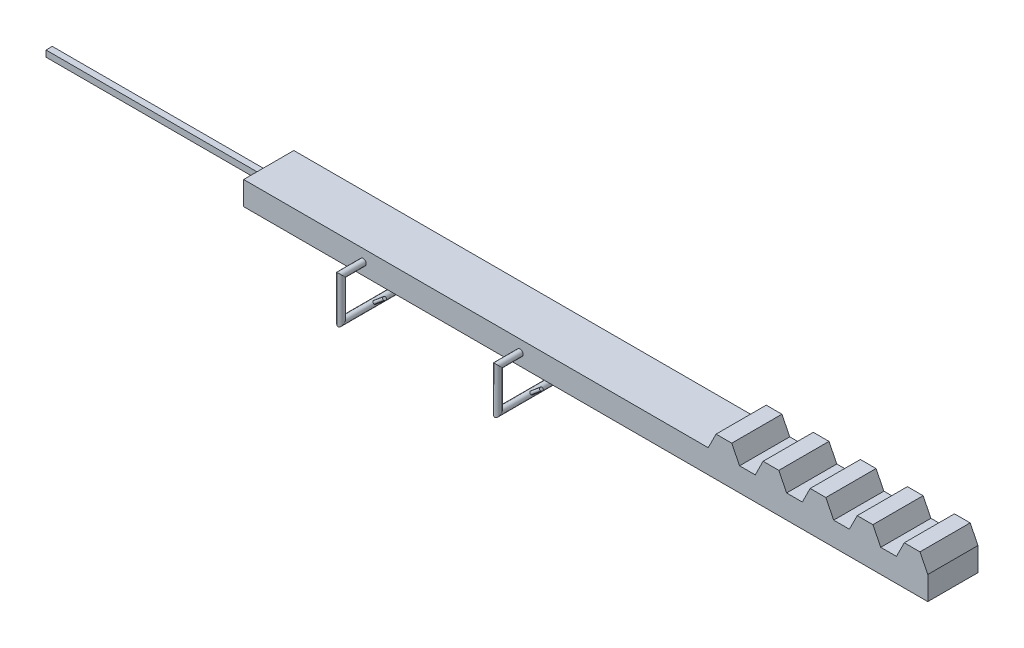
from build123d import *

# Parameters (mm, degrees)
BOSS_EXTRU_1_DEPTH         = 80
BOSS_EXTRU_1_DEPTH_BACK    = 80
ESQUISSE6_W                = 20
ESQUISSE6_H                = 20
BOSS_EXTRU_2_DEPTH         = 700
ESQUISSE5_R                = 10
ESQUISSE7_R                = 5
BOSS_EXTRU_3_DEPTH         = 50
R_P_TITION_LIN_AIRE1_COUNT = 2
R_P_TITION_LIN_AIRE1_PITCH = 500


with BuildPart() as part:
    # Esquisse1 → Boss.-Extru.1 (new, two sides: drawn at the far end of the back side and taken through both)
    with BuildSketch(Plane.XY.offset(-BOSS_EXTRU_1_DEPTH_BACK)):
        Polygon((-380.760603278, 37.5), (1100, 37.5), (1125, 87.5), (1175, 87.5), (1200, 37.5), (1250, 37.5), (1275, 87.5), (1325, 87.5), (1350, 37.5), (1400, 37.5), (1425, 87.5), (1475, 87.5), (1500, 37.5), (1550, 37.5), (1575, 87.5), (1625, 87.5), (1650, 37.5), (1700, 37.5), (1725, 87.5), (1775, 87.5), (1800, 37.5), (1800, -37.5), (-380.760603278, -37.5), align=None)
    extrude(amount=BOSS_EXTRU_1_DEPTH + BOSS_EXTRU_1_DEPTH_BACK)

    # Esquisse6 → Boss.-Extru.2 (add)
    with BuildSketch(Plane.ZY.offset(380.760603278)):
        Rectangle(ESQUISSE6_W, ESQUISSE6_H)
    extrude(amount=BOSS_EXTRU_2_DEPTH)

    # Balayage1: sweep along a curve in space
    with BuildLine() as balayage1_path:
        Line((0, 0, 0), (0, 0, 150))
        Line((0, 0, 150), (0, -128.694367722, 150))
        Line((0, -128.694367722, 150), (0, -128.694367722, -150))
    # Esquisse5 → Balayage1 (sweep)
    with BuildSketch(Plane.XY):
        Circle(ESQUISSE5_R)
    balayage1 = sweep(path=balayage1_path.line, transition=Transition.RIGHT)

    # Esquisse7 → Boss.-Extru.3 (add, symmetric)
    with BuildSketch(Plane(origin=(-63.369605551, -53.173412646, 0), x_dir=(-0.6427876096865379, 0.7660444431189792, 0), z_dir=(0.7660444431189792, 0.6427876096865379, -1.1819491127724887e-15))):
        with Locations((-98.585605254, 50)):
            Circle(ESQUISSE7_R)
        with Locations((-98.585605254, -50)):
            Circle(ESQUISSE7_R)
    boss_extru_3 = extrude(amount=BOSS_EXTRU_3_DEPTH, both=True)

    # R_p_tition lin_aire1: Balayage1, Boss.-Extru.3 ×2
    with Locations(*[(i * R_P_TITION_LIN_AIRE1_PITCH, 0, 0) for i in range(1, R_P_TITION_LIN_AIRE1_COUNT)]):
        add(balayage1)
        add(boss_extru_3)


solid = part.part
